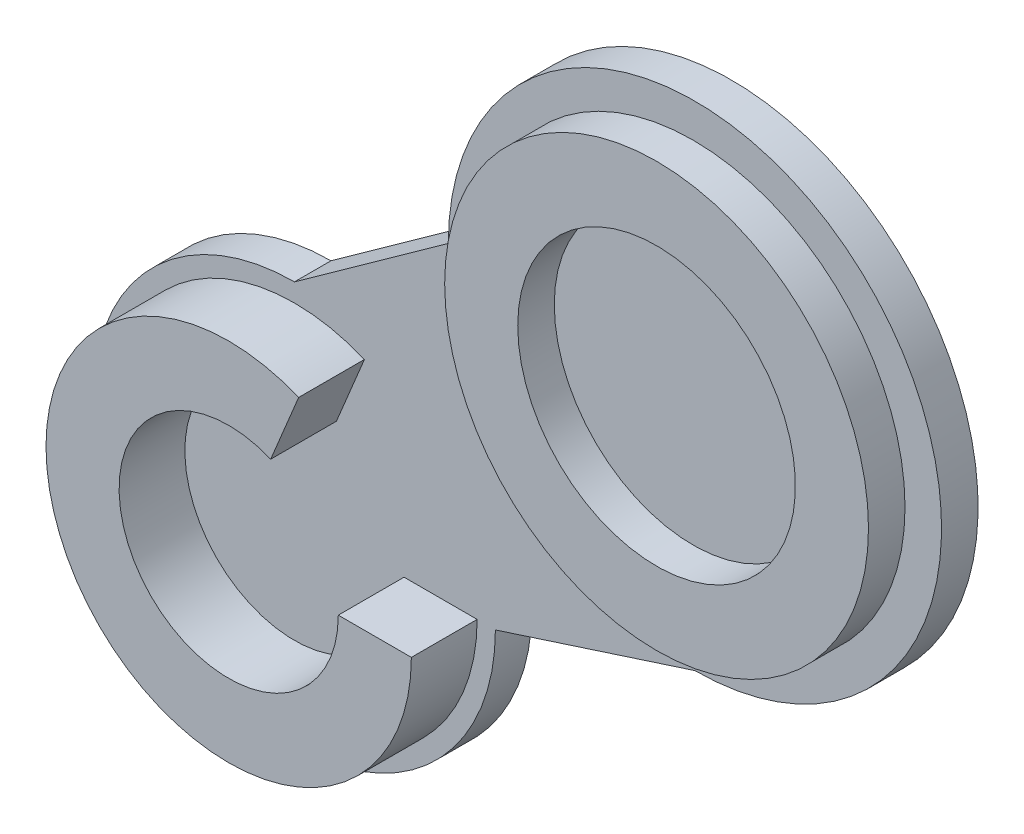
from build123d import *

# Parameters (mm, degrees)
BOSS_EXTRU_1_DEPTH = 1.8
BOSS_EXTRU_2_DEPTH = 1
ESQUISSE4_R        = 5.8
ESQUISSE4_R_2      = 3.8
BOSS_EXTRU_3_DEPTH = 1


with BuildPart() as part:
    # Esquisse1 → Boss.-Extru.1 (new body)
    with BuildSketch(Plane.XY):
        with BuildLine():
            Line((1.149165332, 2.771176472), (1.915275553, 4.618627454))
            ThreePointArc((1.915275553, 4.618627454), (-4.157906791, -2.777014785), (5, 0))
            Line((5, 0), (3, 0))
            ThreePointArc((3, 0), (-2.494744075, -1.666208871), (1.149165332, 2.771176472))
        make_face()
    extrude(amount=BOSS_EXTRU_1_DEPTH)


with BuildPart() as body_2:
    # Esquisse2 → Boss.-Extru.2 (new body)
    with BuildSketch(Plane(origin=(0, 0, 0), x_dir=(-1, 0, 0), z_dir=(0, 0, -1))):
        with BuildLine():
            Line((-10.960999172, 1.765598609), (-5.5, 0))
            ThreePointArc((-5.5, 0), (3.889087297, -3.889087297), (0, 5.5))
            Line((0, 5.5), (-4.210999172, 8.515598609))
            ThreePointArc((-4.210999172, 8.515598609), (-15.733969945, 13.288569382), (-10.960999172, 1.765598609))
        make_face()
    extrude(amount=BOSS_EXTRU_2_DEPTH)

    # Esquisse4 → Boss.-Extru.3 (add)
    with BuildSketch(Plane(origin=(0, 0, 0), x_dir=(-1, 0, 0), z_dir=(0, 0, -1))):
        with Locations((-10.910999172, 8.515598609)):
            Circle(ESQUISSE4_R)
        with Locations((-10.910999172, 8.515598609)):
            Circle(ESQUISSE4_R_2, mode=Mode.SUBTRACT)
    extrude(amount=-BOSS_EXTRU_3_DEPTH)


solid = Compound([part.part, body_2.part])
